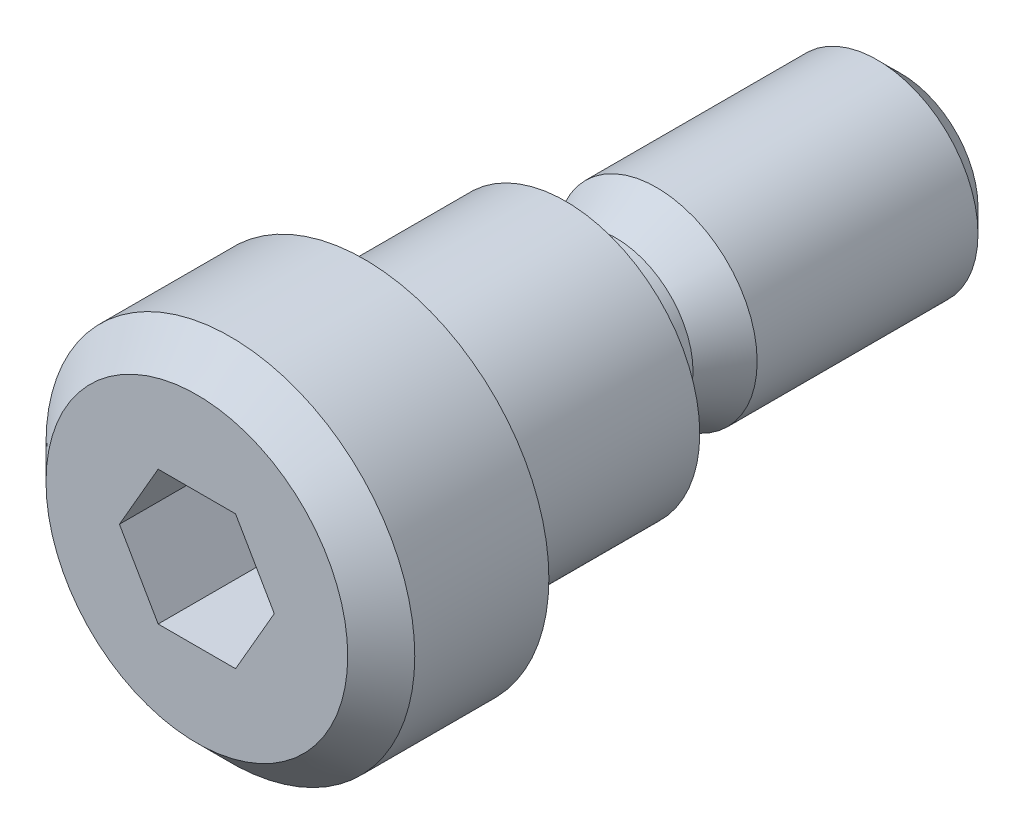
ISO-10303-21;
HEADER;
FILE_DESCRIPTION(('STEP AP214'),'2;1');
FILE_NAME('part.step','',(''),(''),'','','');
FILE_SCHEMA(('AUTOMOTIVE_DESIGN { 1 0 10303 214 1 1 1 1 }'));
ENDSEC;
DATA;
#1=APPLICATION_CONTEXT('core data for automotive mechanical design processes');
#2=APPLICATION_PROTOCOL_DEFINITION('international standard','automotive_design',2000,#1);
#3=PRODUCT_CONTEXT('',#1,'mechanical');
#4=PRODUCT('Part','Part','',(#3));
#5=PRODUCT_RELATED_PRODUCT_CATEGORY('part','',(#4));
#6=PRODUCT_DEFINITION_FORMATION('','',#4);
#7=PRODUCT_DEFINITION_CONTEXT('part definition',#1,'design');
#8=PRODUCT_DEFINITION('design','',#6,#7);
#9=PRODUCT_DEFINITION_SHAPE('','',#8);
#10=(LENGTH_UNIT() NAMED_UNIT(*) SI_UNIT(.MILLI.,.METRE.));
#11=(NAMED_UNIT(*) PLANE_ANGLE_UNIT() SI_UNIT($,.RADIAN.));
#12=(NAMED_UNIT(*) SI_UNIT($,.STERADIAN.) SOLID_ANGLE_UNIT());
#13=UNCERTAINTY_MEASURE_WITH_UNIT(LENGTH_MEASURE(1.E-05),#10,'distance_accuracy_value','');
#14=(GEOMETRIC_REPRESENTATION_CONTEXT(3) GLOBAL_UNCERTAINTY_ASSIGNED_CONTEXT((#13)) GLOBAL_UNIT_ASSIGNED_CONTEXT((#10,
#11,#12)) REPRESENTATION_CONTEXT('',''));
#15=CARTESIAN_POINT('',(0.,0.,0.));
#16=DIRECTION('',(0.,0.,1.));
#17=DIRECTION('',(1.,0.,0.));
#18=AXIS2_PLACEMENT_3D('',#15,#16,#17);
#19=CARTESIAN_POINT('',(0.,0.,-14.1819851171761));
#20=DIRECTION('',(0.,0.,-1.));
#21=DIRECTION('',(-1.,0.,0.));
#22=AXIS2_PLACEMENT_3D('',#19,#20,#21);
#23=CONICAL_SURFACE('',#22,0.499999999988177,1.2217304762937);
#24=CARTESIAN_POINT('',(0.,0.,-14.1819851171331));
#25=DIRECTION('',(0.,0.,1.));
#26=DIRECTION('',(1.,0.,0.));
#27=AXIS2_PLACEMENT_3D('',#24,#25,#26);
#28=CIRCLE('',#27,0.500000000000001);
#29=CARTESIAN_POINT('',(0.500000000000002,0.,-14.1819851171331));
#30=VERTEX_POINT('',#29);
#31=EDGE_CURVE('E236',#30,#30,#28,.F.);
#32=ORIENTED_EDGE('',*,*,#31,.T.);
#33=EDGE_LOOP('',(#32));
#34=FACE_BOUND('',#33,.T.);
#35=CARTESIAN_POINT('',(0.,-2.8421709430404E-10,-14.0000000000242));
#36=VERTEX_POINT('',#35);
#37=VERTEX_LOOP('',#36);
#38=FACE_BOUND('',#37,.T.);
#39=ADVANCED_FACE('F17',(#34,#38),#23,.F.);
#40=CARTESIAN_POINT('',(0.,0.,-14.7209925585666));
#41=DIRECTION('',(0.,0.,1.));
#42=DIRECTION('',(1.,0.,0.));
#43=AXIS2_PLACEMENT_3D('',#40,#41,#42);
#44=CYLINDRICAL_SURFACE('',#43,0.500000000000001);
#45=ORIENTED_EDGE('',*,*,#31,.F.);
#46=EDGE_LOOP('',(#45));
#47=FACE_BOUND('',#46,.T.);
#48=CARTESIAN_POINT('',(0.,0.,-15.260000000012));
#49=DIRECTION('',(0.,0.,-1.));
#50=DIRECTION('',(0.,-1.,0.));
#51=AXIS2_PLACEMENT_3D('',#48,#49,#50);
#52=CIRCLE('',#51,0.499999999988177);
#53=CARTESIAN_POINT('',(0.,-0.499999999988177,-15.260000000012));
#54=VERTEX_POINT('',#53);
#55=EDGE_CURVE('E232',#54,#54,#52,.T.);
#56=ORIENTED_EDGE('',*,*,#55,.T.);
#57=EDGE_LOOP('',(#56));
#58=FACE_BOUND('',#57,.T.);
#59=ADVANCED_FACE('F400',(#47,#58),#44,.F.);
#60=CARTESIAN_POINT('',(0.,0.,-15.999999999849));
#61=DIRECTION('',(0.,0.,-1.));
#62=DIRECTION('',(-1.,0.,0.));
#63=AXIS2_PLACEMENT_3D('',#60,#61,#62);
#64=CONICAL_SURFACE('',#63,0.927239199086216,0.52359877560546);
#65=ORIENTED_EDGE('',*,*,#55,.F.);
#66=EDGE_LOOP('',(#65));
#67=FACE_BOUND('',#66,.T.);
#68=CARTESIAN_POINT('',(0.,0.,-16.0000000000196));
#69=DIRECTION('',(0.,0.,-1.));
#70=DIRECTION('',(-1.,0.,0.));
#71=AXIS2_PLACEMENT_3D('',#68,#69,#70);
#72=CIRCLE('',#71,0.927239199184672);
#73=CARTESIAN_POINT('',(-0.92723919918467,0.,-16.0000000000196));
#74=VERTEX_POINT('',#73);
#75=EDGE_CURVE('E235',#74,#74,#72,.F.);
#76=ORIENTED_EDGE('',*,*,#75,.F.);
#77=EDGE_LOOP('',(#76));
#78=FACE_BOUND('',#77,.T.);
#79=ADVANCED_FACE('F398',(#67,#78),#64,.F.);
#80=CARTESIAN_POINT('',(0.,-1.61361959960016,-16.));
#81=DIRECTION('',(0.,0.,-1.));
#82=DIRECTION('',(-1.,0.,0.));
#83=AXIS2_PLACEMENT_3D('',#80,#81,#82);
#84=PLANE('',#83);
#85=CARTESIAN_POINT('',(0.,0.,-16.0000000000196));
#86=DIRECTION('',(0.,0.,1.));
#87=DIRECTION('',(1.,0.,0.));
#88=AXIS2_PLACEMENT_3D('',#85,#86,#87);
#89=CIRCLE('',#88,2.29999999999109);
#90=CARTESIAN_POINT('',(2.29999999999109,0.,-16.0000000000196));
#91=VERTEX_POINT('',#90);
#92=EDGE_CURVE('E231',#91,#91,#89,.T.);
#93=ORIENTED_EDGE('',*,*,#92,.F.);
#94=EDGE_LOOP('',(#93));
#95=FACE_BOUND('',#94,.T.);
#96=ORIENTED_EDGE('',*,*,#75,.T.);
#97=EDGE_LOOP('',(#96));
#98=FACE_BOUND('',#97,.T.);
#99=ADVANCED_FACE('F396',(#95,#98),#84,.T.);
#100=CARTESIAN_POINT('',(0.,0.,-15.2999999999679));
#101=DIRECTION('',(0.,0.,1.));
#102=DIRECTION('',(1.,0.,0.));
#103=AXIS2_PLACEMENT_3D('',#100,#101,#102);
#104=CONICAL_SURFACE('',#103,3.00000000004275,0.785398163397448);
#105=ORIENTED_EDGE('',*,*,#92,.T.);
#106=EDGE_LOOP('',(#105));
#107=FACE_BOUND('',#106,.T.);
#108=CARTESIAN_POINT('',(0.,0.,-15.3));
#109=DIRECTION('',(0.,0.,1.));
#110=DIRECTION('',(1.,0.,0.));
#111=AXIS2_PLACEMENT_3D('',#108,#109,#110);
#112=CIRCLE('',#111,3.);
#113=CARTESIAN_POINT('',(3.,0.,-15.3));
#114=VERTEX_POINT('',#113);
#115=EDGE_CURVE('E228',#114,#114,#112,.T.);
#116=ORIENTED_EDGE('',*,*,#115,.F.);
#117=EDGE_LOOP('',(#116));
#118=FACE_BOUND('',#117,.T.);
#119=ADVANCED_FACE('F407',(#107,#118),#104,.T.);
#120=CARTESIAN_POINT('',(0.,0.,-12.0062177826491));
#121=DIRECTION('',(0.,0.,1.));
#122=DIRECTION('',(1.,0.,0.));
#123=AXIS2_PLACEMENT_3D('',#120,#121,#122);
#124=CYLINDRICAL_SURFACE('',#123,3.);
#125=ORIENTED_EDGE('',*,*,#115,.T.);
#126=EDGE_LOOP('',(#125));
#127=FACE_BOUND('',#126,.T.);
#128=CARTESIAN_POINT('',(0.,0.,-8.71243556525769));
#129=DIRECTION('',(0.,0.,-1.));
#130=DIRECTION('',(0.,-1.,0.));
#131=AXIS2_PLACEMENT_3D('',#128,#129,#130);
#132=CIRCLE('',#131,3.00000000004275);
#133=CARTESIAN_POINT('',(0.,-3.00000000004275,-8.71243556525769));
#134=VERTEX_POINT('',#133);
#135=EDGE_CURVE('E225',#134,#134,#132,.F.);
#136=ORIENTED_EDGE('',*,*,#135,.F.);
#137=EDGE_LOOP('',(#136));
#138=FACE_BOUND('',#137,.T.);
#139=ADVANCED_FACE('F415',(#127,#138),#124,.T.);
#140=CARTESIAN_POINT('',(0.,0.,-8.71243556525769));
#141=DIRECTION('',(0.,0.,-1.));
#142=DIRECTION('',(-1.,0.,0.));
#143=AXIS2_PLACEMENT_3D('',#140,#141,#142);
#144=CONICAL_SURFACE('',#143,3.00000000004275,0.523598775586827);
#145=ORIENTED_EDGE('',*,*,#135,.T.);
#146=EDGE_LOOP('',(#145));
#147=FACE_BOUND('',#146,.T.);
#148=CARTESIAN_POINT('',(0.,0.,-7.5));
#149=DIRECTION('',(0.,0.,1.));
#150=DIRECTION('',(1.,0.,0.));
#151=AXIS2_PLACEMENT_3D('',#148,#149,#150);
#152=CIRCLE('',#151,2.3);
#153=CARTESIAN_POINT('',(2.3,0.,-7.5));
#154=VERTEX_POINT('',#153);
#155=EDGE_CURVE('E222',#154,#154,#152,.T.);
#156=ORIENTED_EDGE('',*,*,#155,.F.);
#157=EDGE_LOOP('',(#156));
#158=FACE_BOUND('',#157,.T.);
#159=ADVANCED_FACE('F419',(#147,#158),#144,.T.);
#160=CARTESIAN_POINT('',(0.,0.,-7.));
#161=DIRECTION('',(0.,0.,1.));
#162=DIRECTION('',(1.,0.,0.));
#163=AXIS2_PLACEMENT_3D('',#160,#161,#162);
#164=CYLINDRICAL_SURFACE('',#163,2.3);
#165=ORIENTED_EDGE('',*,*,#155,.T.);
#166=EDGE_LOOP('',(#165));
#167=FACE_BOUND('',#166,.T.);
#168=CARTESIAN_POINT('',(0.,0.,-6.5));
#169=DIRECTION('',(0.,0.,-1.));
#170=DIRECTION('',(-1.,0.,0.));
#171=AXIS2_PLACEMENT_3D('',#168,#169,#170);
#172=CIRCLE('',#171,2.3);
#173=CARTESIAN_POINT('',(-2.3,0.,-6.5));
#174=VERTEX_POINT('',#173);
#175=EDGE_CURVE('E214',#174,#174,#172,.T.);
#176=ORIENTED_EDGE('',*,*,#175,.T.);
#177=EDGE_LOOP('',(#176));
#178=FACE_BOUND('',#177,.T.);
#179=ADVANCED_FACE('F422',(#167,#178),#164,.T.);
#180=CARTESIAN_POINT('',(0.,0.,-6.5));
#181=DIRECTION('',(0.,0.,-1.));
#182=DIRECTION('',(-1.,0.,0.));
#183=AXIS2_PLACEMENT_3D('',#180,#181,#182);
#184=TOROIDAL_SURFACE('',#183,2.8,0.5);
#185=ORIENTED_EDGE('',*,*,#175,.F.);
#186=EDGE_LOOP('',(#185));
#187=FACE_BOUND('',#186,.T.);
#188=CARTESIAN_POINT('',(0.,0.,-6.));
#189=DIRECTION('',(0.,0.,-1.));
#190=DIRECTION('',(0.,-1.,0.));
#191=AXIS2_PLACEMENT_3D('',#188,#189,#190);
#192=CIRCLE('',#191,2.8);
#193=CARTESIAN_POINT('',(-2.8,0.,-6.));
#194=VERTEX_POINT('',#193);
#195=CARTESIAN_POINT('',(0.,-2.8,-6.));
#196=VERTEX_POINT('',#195);
#197=EDGE_CURVE('E166',#194,#196,#192,.F.);
#198=ORIENTED_EDGE('',*,*,#197,.F.);
#199=CARTESIAN_POINT('',(0.,0.,-6.));
#200=DIRECTION('',(0.,0.,-1.));
#201=DIRECTION('',(-1.,0.,0.));
#202=AXIS2_PLACEMENT_3D('',#199,#200,#201);
#203=CIRCLE('',#202,2.8);
#204=CARTESIAN_POINT('',(2.8,0.,-6.));
#205=VERTEX_POINT('',#204);
#206=EDGE_CURVE('E199',#205,#194,#203,.F.);
#207=ORIENTED_EDGE('',*,*,#206,.F.);
#208=CARTESIAN_POINT('',(0.,0.,-6.));
#209=DIRECTION('',(0.,0.,-1.));
#210=DIRECTION('',(1.,0.,0.));
#211=AXIS2_PLACEMENT_3D('',#208,#209,#210);
#212=CIRCLE('',#211,2.8);
#213=EDGE_CURVE('E375',#196,#205,#212,.F.);
#214=ORIENTED_EDGE('',*,*,#213,.F.);
#215=EDGE_LOOP('',(#198,#207,#214));
#216=FACE_BOUND('',#215,.T.);
#217=ADVANCED_FACE('F181',(#187,#216),#184,.F.);
#218=CARTESIAN_POINT('',(0.,-3.4,-6.));
#219=DIRECTION('',(0.,0.,-1.));
#220=DIRECTION('',(-1.,0.,0.));
#221=AXIS2_PLACEMENT_3D('',#218,#219,#220);
#222=PLANE('',#221);
#223=CARTESIAN_POINT('',(0.,0.,-6.));
#224=DIRECTION('',(0.,0.,1.));
#225=DIRECTION('',(1.,0.,0.));
#226=AXIS2_PLACEMENT_3D('',#223,#224,#225);
#227=CIRCLE('',#226,4.);
#228=CARTESIAN_POINT('',(4.,0.,-6.));
#229=VERTEX_POINT('',#228);
#230=EDGE_CURVE('E283',#229,#229,#227,.T.);
#231=ORIENTED_EDGE('',*,*,#230,.F.);
#232=EDGE_LOOP('',(#231));
#233=FACE_BOUND('',#232,.T.);
#234=ORIENTED_EDGE('',*,*,#213,.T.);
#235=ORIENTED_EDGE('',*,*,#206,.T.);
#236=ORIENTED_EDGE('',*,*,#197,.T.);
#237=EDGE_LOOP('',(#234,#235,#236));
#238=FACE_BOUND('',#237,.T.);
#239=ADVANCED_FACE('F172',(#233,#238),#222,.T.);
#240=CARTESIAN_POINT('',(0.,0.,2.00799999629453));
#241=DIRECTION('',(0.,0.,1.));
#242=DIRECTION('',(1.,0.,0.));
#243=AXIS2_PLACEMENT_3D('',#240,#241,#242);
#244=CONICAL_SURFACE('',#243,2.32325640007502,1.04719755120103);
#245=CARTESIAN_POINT('',(1.15470000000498,1.99999906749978,1.99999999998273));
#246=CARTESIAN_POINT('',(1.05991057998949,1.99999906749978,1.97263378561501));
#247=CARTESIAN_POINT('',(0.964371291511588,1.99999906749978,1.94757924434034));
#248=CARTESIAN_POINT('',(0.771740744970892,1.99999906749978,1.9032984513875));
#249=CARTESIAN_POINT('',(0.674646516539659,1.99999906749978,1.88408524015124));
#250=CARTESIAN_POINT('',(0.481547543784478,1.99999906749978,1.85318807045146));
#251=CARTESIAN_POINT('',(0.385569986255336,1.99999906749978,1.84133938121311));
#252=CARTESIAN_POINT('',(0.193061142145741,1.99999906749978,1.82543321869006));
#253=CARTESIAN_POINT('',(0.0965305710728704,1.99999906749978,1.8213672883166));
#254=CARTESIAN_POINT('',(-0.0965305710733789,1.99999906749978,1.8213672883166));
#255=CARTESIAN_POINT('',(-0.193061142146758,1.99999906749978,1.8254332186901));
#256=CARTESIAN_POINT('',(-0.385569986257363,1.99999906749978,1.84133938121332));
#257=CARTESIAN_POINT('',(-0.481547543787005,1.99999906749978,1.85318807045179));
#258=CARTESIAN_POINT('',(-0.674646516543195,1.99999906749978,1.88408524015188));
#259=CARTESIAN_POINT('',(-0.771740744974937,1.99999906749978,1.90329845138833));
#260=CARTESIAN_POINT('',(-0.964371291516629,1.99999906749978,1.9475792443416));
#261=CARTESIAN_POINT('',(-1.05991057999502,1.99999906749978,1.9726337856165));
#262=CARTESIAN_POINT('',(-1.154700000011,1.99999906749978,1.99999999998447));
#263=B_SPLINE_CURVE_WITH_KNOTS('',3,(#245,#246,#247,#248,#249,#250,#251,#252,#253,#254,#255,
#256,#257,#258,#259,#260,#261,#262),.UNSPECIFIED.,.F.,.F.,(4,2,2,2,2,2,2,2,4),(0.,
0.296073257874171,0.592802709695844,0.882630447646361,1.17214306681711,1.46165568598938,
1.75148342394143,2.04821287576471,2.34428613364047),.UNSPECIFIED.);
#264=CARTESIAN_POINT('',(1.15470000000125,1.99999906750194,1.99999999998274));
#265=VERTEX_POINT('',#264);
#266=CARTESIAN_POINT('',(-1.15470000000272,1.99999906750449,1.99999999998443));
#267=VERTEX_POINT('',#266);
#268=EDGE_CURVE('E93',#265,#267,#263,.T.);
#269=ORIENTED_EDGE('',*,*,#268,.T.);
#270=CARTESIAN_POINT('',(-1.1546999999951,1.99999906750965,1.99999999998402));
#271=CARTESIAN_POINT('',(-1.2054420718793,1.91211122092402,1.97069555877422));
#272=CARTESIAN_POINT('',(-1.25662214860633,1.82346472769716,1.9440447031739));
#273=CARTESIAN_POINT('',(-1.35986845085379,1.64463688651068,1.89752643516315));
#274=CARTESIAN_POINT('',(-1.41193651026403,1.55445236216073,1.87767547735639));
#275=CARTESIAN_POINT('',(-1.51542737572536,1.37520092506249,1.84677603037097));
#276=CARTESIAN_POINT('',(-1.56683426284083,1.28616158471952,1.83552186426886));
#277=CARTESIAN_POINT('',(-1.66988979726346,1.10766416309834,1.82208925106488));
#278=CARTESIAN_POINT('',(-1.7215380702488,1.01820673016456,1.81989967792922));
#279=CARTESIAN_POINT('',(-1.81803732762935,0.851065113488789,1.82446637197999));
#280=CARTESIAN_POINT('',(-1.86290279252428,0.773355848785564,1.83010136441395));
#281=CARTESIAN_POINT('',(-1.9523414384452,0.618443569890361,1.84795737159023));
#282=CARTESIAN_POINT('',(-1.99691431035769,0.541241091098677,1.86018447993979));
#283=CARTESIAN_POINT('',(-2.08653720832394,0.386009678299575,1.89074988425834));
#284=CARTESIAN_POINT('',(-2.13157589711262,0.308000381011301,1.90921768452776));
#285=CARTESIAN_POINT('',(-2.22098171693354,0.153144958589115,1.95113178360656));
#286=CARTESIAN_POINT('',(-2.26534999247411,0.0762968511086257,1.97456824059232));
#287=CARTESIAN_POINT('',(-2.30940000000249,-4.31724869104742E-12,1.99999999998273));
#288=B_SPLINE_CURVE_WITH_KNOTS('',3,(#270,#271,#272,#273,#274,#275,#276,#277,#278,#279,#280,
#281,#282,#283,#284,#285,#286,#287),.UNSPECIFIED.,.F.,.F.,(4,2,2,2,2,2,2,2,4),(0.,
0.317015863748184,0.634793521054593,0.944707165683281,1.25424030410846,1.52370707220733,
1.79342335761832,2.06912065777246,2.3442768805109),.UNSPECIFIED.);
#289=CARTESIAN_POINT('',(-2.30940000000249,0.,1.99999999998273));
#290=VERTEX_POINT('',#289);
#291=EDGE_CURVE('E98',#267,#290,#288,.T.);
#292=ORIENTED_EDGE('',*,*,#291,.T.);
#293=CARTESIAN_POINT('',(-2.30940000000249,4.31510744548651E-12,1.99999999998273));
#294=CARTESIAN_POINT('',(-2.25865792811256,-0.0878878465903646,1.97069555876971));
#295=CARTESIAN_POINT('',(-2.20747785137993,-0.176534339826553,1.94404470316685));
#296=CARTESIAN_POINT('',(-2.10423154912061,-0.35536218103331,1.89752643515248));
#297=CARTESIAN_POINT('',(-2.05216348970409,-0.445546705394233,1.87767547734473));
#298=CARTESIAN_POINT('',(-1.9486726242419,-0.624798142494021,1.84677603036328));
#299=CARTESIAN_POINT('',(-1.897265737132,-0.71383748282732,1.83552186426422));
#300=CARTESIAN_POINT('',(-1.79421020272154,-0.89233490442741,1.82208925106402));
#301=CARTESIAN_POINT('',(-1.7425619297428,-0.981792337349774,1.81989967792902));
#302=CARTESIAN_POINT('',(-1.64606267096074,-1.14893395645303,1.82446637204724));
#303=CARTESIAN_POINT('',(-1.60119720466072,-1.22664322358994,1.83010136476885));
#304=CARTESIAN_POINT('',(-1.51175855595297,-1.38155550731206,1.84795737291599));
#305=CARTESIAN_POINT('',(-1.46718568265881,-1.45875798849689,1.8601844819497));
#306=CARTESIAN_POINT('',(-1.37756278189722,-1.61398940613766,1.89074988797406));
#307=CARTESIAN_POINT('',(-1.33252409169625,-1.69199870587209,1.90921768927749));
#308=CARTESIAN_POINT('',(-1.24311826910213,-1.84685413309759,1.95113179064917));
#309=CARTESIAN_POINT('',(-1.19874999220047,-1.92370224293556,1.97456824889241));
#310=CARTESIAN_POINT('',(-1.15469998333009,-1.99999909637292,2.00000000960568));
#311=B_SPLINE_CURVE_WITH_KNOTS('',3,(#293,#294,#295,#296,#297,#298,#299,#300,#301,#302,#303,
#304,#305,#306,#307,#308,#309,#310),.UNSPECIFIED.,.F.,.F.,(4,2,2,2,2,2,2,2,4),(0.,
0.317015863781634,0.634793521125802,0.94470716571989,1.25424030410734,1.52370708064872,
1.79342337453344,2.06912068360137,2.34427691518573),.UNSPECIFIED.);
#312=CARTESIAN_POINT('',(-1.15469994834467,-1.99999908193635,1.99999999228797));
#313=VERTEX_POINT('',#312);
#314=EDGE_CURVE('E126',#290,#313,#311,.T.);
#315=ORIENTED_EDGE('',*,*,#314,.T.);
#316=CARTESIAN_POINT('',(1.154700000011,-1.99999906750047,1.99999999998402));
#317=CARTESIAN_POINT('',(1.05991058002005,-1.99999906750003,1.97263378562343));
#318=CARTESIAN_POINT('',(0.964371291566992,-1.99999906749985,1.9475792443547));
#319=CARTESIAN_POINT('',(0.771740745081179,-1.99999906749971,1.90329845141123));
#320=CARTESIAN_POINT('',(0.674646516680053,-1.99999906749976,1.88408524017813));
#321=CARTESIAN_POINT('',(0.481547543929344,-1.9999990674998,1.85318807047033));
#322=CARTESIAN_POINT('',(0.385569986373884,-1.99999906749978,1.84133938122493));
#323=CARTESIAN_POINT('',(0.193061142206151,-1.99999906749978,1.82543321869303));
#324=CARTESIAN_POINT('',(0.0965305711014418,-1.99999906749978,1.82136728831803));
#325=CARTESIAN_POINT('',(-0.0965305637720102,-1.99999906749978,1.82136728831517));
#326=CARTESIAN_POINT('',(-0.193061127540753,-1.99999906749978,1.82543321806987));
#327=CARTESIAN_POINT('',(-0.385569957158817,-1.99999906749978,1.84133937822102));
#328=CARTESIAN_POINT('',(-0.48154750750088,-1.99999906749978,1.85318806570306));
#329=CARTESIAN_POINT('',(-0.674646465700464,-1.99999906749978,1.88408523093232));
#330=CARTESIAN_POINT('',(-0.771740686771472,-1.99999906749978,1.90329843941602));
#331=CARTESIAN_POINT('',(-0.964371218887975,-1.99999906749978,1.94757922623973));
#332=CARTESIAN_POINT('',(-1.05991050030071,-1.99999906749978,1.97263376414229));
#333=CARTESIAN_POINT('',(-1.1546999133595,-1.99999906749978,1.99999997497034));
#334=B_SPLINE_CURVE_WITH_KNOTS('',3,(#316,#317,#318,#319,#320,#321,#322,#323,#324,#325,#326,
#327,#328,#329,#330,#331,#332,#333),.UNSPECIFIED.,.F.,.F.,(4,2,2,2,2,2,2,2,4),(0.,
0.296073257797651,0.592802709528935,0.882630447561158,1.17214306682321,1.46165566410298,
1.75148338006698,2.04821280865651,2.34428604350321),.UNSPECIFIED.);
#335=CARTESIAN_POINT('',(1.15470000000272,-1.99999906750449,1.99999999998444));
#336=VERTEX_POINT('',#335);
#337=EDGE_CURVE('E383',#336,#313,#334,.T.);
#338=ORIENTED_EDGE('',*,*,#337,.F.);
#339=CARTESIAN_POINT('',(1.1546999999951,-1.99999906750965,1.99999999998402));
#340=CARTESIAN_POINT('',(1.2054420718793,-1.91211122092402,1.97069555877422));
#341=CARTESIAN_POINT('',(1.25662214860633,-1.82346472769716,1.9440447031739));
#342=CARTESIAN_POINT('',(1.35986845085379,-1.64463688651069,1.89752643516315));
#343=CARTESIAN_POINT('',(1.41193651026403,-1.55445236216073,1.87767547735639));
#344=CARTESIAN_POINT('',(1.51542737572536,-1.3752009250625,1.84677603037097));
#345=CARTESIAN_POINT('',(1.56683426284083,-1.28616158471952,1.83552186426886));
#346=CARTESIAN_POINT('',(1.66988979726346,-1.10766416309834,1.82208925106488));
#347=CARTESIAN_POINT('',(1.7215380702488,-1.01820673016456,1.81989967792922));
#348=CARTESIAN_POINT('',(1.81803732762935,-0.85106511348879,1.82446637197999));
#349=CARTESIAN_POINT('',(1.86290279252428,-0.773355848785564,1.83010136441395));
#350=CARTESIAN_POINT('',(1.9523414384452,-0.618443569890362,1.84795737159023));
#351=CARTESIAN_POINT('',(1.99691431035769,-0.541241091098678,1.86018447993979));
#352=CARTESIAN_POINT('',(2.08653720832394,-0.386009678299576,1.89074988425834));
#353=CARTESIAN_POINT('',(2.13157589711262,-0.308000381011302,1.90921768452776));
#354=CARTESIAN_POINT('',(2.22098171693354,-0.153144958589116,1.95113178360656));
#355=CARTESIAN_POINT('',(2.26534999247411,-0.0762968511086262,1.97456824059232));
#356=CARTESIAN_POINT('',(2.30940000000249,4.31705356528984E-12,1.99999999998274));
#357=B_SPLINE_CURVE_WITH_KNOTS('',3,(#339,#340,#341,#342,#343,#344,#345,#346,#347,#348,#349,
#350,#351,#352,#353,#354,#355,#356),.UNSPECIFIED.,.F.,.F.,(4,2,2,2,2,2,2,2,4),(0.,
0.317015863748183,0.634793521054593,0.94470716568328,1.25424030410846,1.52370707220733,
1.79342335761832,2.06912065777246,2.3442768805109),.UNSPECIFIED.);
#358=CARTESIAN_POINT('',(2.30940000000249,0.,1.99999999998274));
#359=VERTEX_POINT('',#358);
#360=EDGE_CURVE('E242',#336,#359,#357,.T.);
#361=ORIENTED_EDGE('',*,*,#360,.T.);
#362=CARTESIAN_POINT('',(2.30940000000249,-4.31498290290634E-12,1.99999999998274));
#363=CARTESIAN_POINT('',(2.25865792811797,0.0878878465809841,1.9706955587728));
#364=CARTESIAN_POINT('',(2.20747785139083,0.176534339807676,1.94404470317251));
#365=CARTESIAN_POINT('',(2.10423154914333,0.355362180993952,1.89752643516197));
#366=CARTESIAN_POINT('',(2.05216348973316,0.445546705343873,1.8776754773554));
#367=CARTESIAN_POINT('',(1.94867262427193,0.624798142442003,1.84677603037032));
#368=CARTESIAN_POINT('',(1.89726573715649,0.713837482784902,1.83552186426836));
#369=CARTESIAN_POINT('',(1.79421020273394,0.892334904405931,1.82208925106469));
#370=CARTESIAN_POINT('',(1.74256192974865,0.981792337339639,1.8198996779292));
#371=CARTESIAN_POINT('',(1.64606267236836,1.14893395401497,1.82446637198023));
#372=CARTESIAN_POINT('',(1.60119720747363,1.22664321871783,1.83010136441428));
#373=CARTESIAN_POINT('',(1.51175856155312,1.38155549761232,1.84795737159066));
#374=CARTESIAN_POINT('',(1.46718568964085,1.45875797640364,1.86018447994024));
#375=CARTESIAN_POINT('',(1.37756279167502,1.61398938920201,1.89074988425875));
#376=CARTESIAN_POINT('',(1.33252410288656,1.69199868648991,1.90921768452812));
#377=CARTESIAN_POINT('',(1.24311828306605,1.84685410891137,1.95113178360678));
#378=CARTESIAN_POINT('',(1.19875000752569,1.92370221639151,1.97456824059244));
#379=CARTESIAN_POINT('',(1.15469999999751,1.9999990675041,1.99999999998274));
#380=B_SPLINE_CURVE_WITH_KNOTS('',3,(#362,#363,#364,#365,#366,#367,#368,#369,#370,#371,#372,
#373,#374,#375,#376,#377,#378,#379),.UNSPECIFIED.,.F.,.F.,(4,2,2,2,2,2,2,2,4),(0.,
0.317015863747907,0.634793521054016,0.944707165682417,1.25424030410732,1.52370707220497,
1.79342335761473,2.06912065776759,2.34427688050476),.UNSPECIFIED.);
#381=EDGE_CURVE('E101',#359,#265,#380,.T.);
#382=ORIENTED_EDGE('',*,*,#381,.T.);
#383=EDGE_LOOP('',(#269,#292,#315,#338,#361,#382));
#384=FACE_BOUND('',#383,.T.);
#385=CARTESIAN_POINT('',(0.,2.8421709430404E-11,0.666667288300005));
#386=VERTEX_POINT('',#385);
#387=VERTEX_LOOP('',#386);
#388=FACE_BOUND('',#387,.T.);
#389=ADVANCED_FACE('F95',(#384,#388),#244,.F.);
#390=CARTESIAN_POINT('',(0.,0.,-3.5));
#391=DIRECTION('',(0.,0.,1.));
#392=DIRECTION('',(1.,0.,0.));
#393=AXIS2_PLACEMENT_3D('',#390,#391,#392);
#394=CYLINDRICAL_SURFACE('',#393,4.);
#395=ORIENTED_EDGE('',*,*,#230,.T.);
#396=EDGE_LOOP('',(#395));
#397=FACE_BOUND('',#396,.T.);
#398=CARTESIAN_POINT('',(0.,0.,-1.));
#399=DIRECTION('',(0.,0.,-1.));
#400=DIRECTION('',(-1.,0.,0.));
#401=AXIS2_PLACEMENT_3D('',#398,#399,#400);
#402=CIRCLE('',#401,4.);
#403=CARTESIAN_POINT('',(-4.,0.,-1.));
#404=VERTEX_POINT('',#403);
#405=EDGE_CURVE('E129',#404,#404,#402,.T.);
#406=ORIENTED_EDGE('',*,*,#405,.T.);
#407=EDGE_LOOP('',(#406));
#408=FACE_BOUND('',#407,.T.);
#409=ADVANCED_FACE('F288',(#397,#408),#394,.T.);
#410=CARTESIAN_POINT('',(-2.3094,0.,5.));
#411=DIRECTION('',(-0.866025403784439,-0.5,0.));
#412=DIRECTION('',(0.5,-0.866025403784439,0.));
#413=AXIS2_PLACEMENT_3D('',#410,#411,#412);
#414=PLANE('',#413);
#415=DIRECTION('',(0.,0.,1.));
#416=VECTOR('',#415,1.);
#417=CARTESIAN_POINT('',(-2.3094,0.,5.));
#418=LINE('',#417,#416);
#419=CARTESIAN_POINT('',(-2.3094,0.,5.));
#420=VERTEX_POINT('',#419);
#421=EDGE_CURVE('E112',#290,#420,#418,.T.);
#422=ORIENTED_EDGE('',*,*,#421,.T.);
#423=DIRECTION('',(-0.500000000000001,0.866025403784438,0.));
#424=VECTOR('',#423,1.);
#425=CARTESIAN_POINT('',(-1.1547,-1.99999906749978,5.));
#426=LINE('',#425,#424);
#427=CARTESIAN_POINT('',(-1.1547,-1.99999906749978,5.));
#428=VERTEX_POINT('',#427);
#429=EDGE_CURVE('E132',#428,#420,#426,.T.);
#430=ORIENTED_EDGE('',*,*,#429,.F.);
#431=DIRECTION('',(0.,0.,-1.));
#432=VECTOR('',#431,1.);
#433=CARTESIAN_POINT('',(-1.1547,-1.99999906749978,5.));
#434=LINE('',#433,#432);
#435=EDGE_CURVE('E133',#428,#313,#434,.T.);
#436=ORIENTED_EDGE('',*,*,#435,.T.);
#437=ORIENTED_EDGE('',*,*,#314,.F.);
#438=EDGE_LOOP('',(#422,#430,#436,#437));
#439=FACE_BOUND('',#438,.T.);
#440=ADVANCED_FACE('F285',(#439),#414,.F.);
#441=CARTESIAN_POINT('',(-1.1547,1.99999906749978,5.));
#442=DIRECTION('',(-0.866025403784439,0.5,0.));
#443=DIRECTION('',(-0.5,-0.866025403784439,0.));
#444=AXIS2_PLACEMENT_3D('',#441,#442,#443);
#445=PLANE('',#444);
#446=DIRECTION('',(0.,0.,1.));
#447=VECTOR('',#446,1.);
#448=CARTESIAN_POINT('',(-1.1547,1.99999906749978,5.));
#449=LINE('',#448,#447);
#450=CARTESIAN_POINT('',(-1.1547,1.99999906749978,5.));
#451=VERTEX_POINT('',#450);
#452=EDGE_CURVE('E106',#267,#451,#449,.T.);
#453=ORIENTED_EDGE('',*,*,#452,.T.);
#454=DIRECTION('',(0.5,0.866025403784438,0.));
#455=VECTOR('',#454,1.);
#456=CARTESIAN_POINT('',(-2.3094,0.,5.));
#457=LINE('',#456,#455);
#458=EDGE_CURVE('E136',#420,#451,#457,.T.);
#459=ORIENTED_EDGE('',*,*,#458,.F.);
#460=ORIENTED_EDGE('',*,*,#421,.F.);
#461=ORIENTED_EDGE('',*,*,#291,.F.);
#462=EDGE_LOOP('',(#453,#459,#460,#461));
#463=FACE_BOUND('',#462,.T.);
#464=ADVANCED_FACE('F109',(#463),#445,.F.);
#465=CARTESIAN_POINT('',(1.1547,1.99999906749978,5.));
#466=DIRECTION('',(0.,1.,0.));
#467=DIRECTION('',(-1.,0.,0.));
#468=AXIS2_PLACEMENT_3D('',#465,#466,#467);
#469=PLANE('',#468);
#470=ORIENTED_EDGE('',*,*,#268,.F.);
#471=DIRECTION('',(0.,0.,1.));
#472=VECTOR('',#471,1.);
#473=CARTESIAN_POINT('',(1.1547,1.99999906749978,5.));
#474=LINE('',#473,#472);
#475=CARTESIAN_POINT('',(1.1547,1.99999906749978,5.));
#476=VERTEX_POINT('',#475);
#477=EDGE_CURVE('E105',#265,#476,#474,.T.);
#478=ORIENTED_EDGE('',*,*,#477,.T.);
#479=DIRECTION('',(1.,0.,0.));
#480=VECTOR('',#479,1.);
#481=CARTESIAN_POINT('',(0.,1.99999906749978,5.));
#482=LINE('',#481,#480);
#483=EDGE_CURVE('E116',#451,#476,#482,.T.);
#484=ORIENTED_EDGE('',*,*,#483,.F.);
#485=ORIENTED_EDGE('',*,*,#452,.F.);
#486=EDGE_LOOP('',(#470,#478,#484,#485));
#487=FACE_BOUND('',#486,.T.);
#488=ADVANCED_FACE('F114',(#487),#469,.F.);
#489=CARTESIAN_POINT('',(2.3094,0.,5.));
#490=DIRECTION('',(0.866025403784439,0.5,0.));
#491=DIRECTION('',(-0.5,0.866025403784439,0.));
#492=AXIS2_PLACEMENT_3D('',#489,#490,#491);
#493=PLANE('',#492);
#494=DIRECTION('',(0.,0.,1.));
#495=VECTOR('',#494,1.);
#496=CARTESIAN_POINT('',(2.3094,0.,5.));
#497=LINE('',#496,#495);
#498=CARTESIAN_POINT('',(2.3094,0.,5.));
#499=VERTEX_POINT('',#498);
#500=EDGE_CURVE('E249',#359,#499,#497,.T.);
#501=ORIENTED_EDGE('',*,*,#500,.T.);
#502=DIRECTION('',(0.5,-0.866025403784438,0.));
#503=VECTOR('',#502,1.);
#504=CARTESIAN_POINT('',(1.1547,1.99999906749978,5.));
#505=LINE('',#504,#503);
#506=EDGE_CURVE('E148',#476,#499,#505,.T.);
#507=ORIENTED_EDGE('',*,*,#506,.F.);
#508=ORIENTED_EDGE('',*,*,#477,.F.);
#509=ORIENTED_EDGE('',*,*,#381,.F.);
#510=EDGE_LOOP('',(#501,#507,#508,#509));
#511=FACE_BOUND('',#510,.T.);
#512=ADVANCED_FACE('F259',(#511),#493,.F.);
#513=CARTESIAN_POINT('',(1.1547,-1.99999906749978,5.));
#514=DIRECTION('',(0.866025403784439,-0.5,0.));
#515=DIRECTION('',(0.5,0.866025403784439,0.));
#516=AXIS2_PLACEMENT_3D('',#513,#514,#515);
#517=PLANE('',#516);
#518=DIRECTION('',(0.,0.,-1.));
#519=VECTOR('',#518,1.);
#520=CARTESIAN_POINT('',(1.1547,-1.99999906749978,5.));
#521=LINE('',#520,#519);
#522=CARTESIAN_POINT('',(1.1547,-1.99999906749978,5.));
#523=VERTEX_POINT('',#522);
#524=EDGE_CURVE('E248',#336,#523,#521,.F.);
#525=ORIENTED_EDGE('',*,*,#524,.T.);
#526=DIRECTION('',(-0.5,-0.866025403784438,0.));
#527=VECTOR('',#526,1.);
#528=CARTESIAN_POINT('',(2.3094,0.,5.));
#529=LINE('',#528,#527);
#530=EDGE_CURVE('E143',#499,#523,#529,.T.);
#531=ORIENTED_EDGE('',*,*,#530,.F.);
#532=ORIENTED_EDGE('',*,*,#500,.F.);
#533=ORIENTED_EDGE('',*,*,#360,.F.);
#534=EDGE_LOOP('',(#525,#531,#532,#533));
#535=FACE_BOUND('',#534,.T.);
#536=ADVANCED_FACE('F254',(#535),#517,.F.);
#537=CARTESIAN_POINT('',(-1.1547,-1.99999906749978,5.));
#538=DIRECTION('',(0.,-1.,0.));
#539=DIRECTION('',(0.,0.,-1.));
#540=AXIS2_PLACEMENT_3D('',#537,#538,#539);
#541=PLANE('',#540);
#542=ORIENTED_EDGE('',*,*,#337,.T.);
#543=ORIENTED_EDGE('',*,*,#435,.F.);
#544=DIRECTION('',(1.,0.,0.));
#545=VECTOR('',#544,1.);
#546=CARTESIAN_POINT('',(0.,-1.99999906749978,5.));
#547=LINE('',#546,#545);
#548=EDGE_CURVE('E139',#523,#428,#547,.F.);
#549=ORIENTED_EDGE('',*,*,#548,.F.);
#550=ORIENTED_EDGE('',*,*,#524,.F.);
#551=EDGE_LOOP('',(#542,#543,#549,#550));
#552=FACE_BOUND('',#551,.T.);
#553=ADVANCED_FACE('F258',(#552),#541,.F.);
#554=CARTESIAN_POINT('',(0.,-2.25,5.));
#555=DIRECTION('',(0.,0.,1.));
#556=DIRECTION('',(1.,0.,0.));
#557=AXIS2_PLACEMENT_3D('',#554,#555,#556);
#558=PLANE('',#557);
#559=CARTESIAN_POINT('',(0.,0.,4.99999999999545));
#560=DIRECTION('',(0.,0.,-1.));
#561=DIRECTION('',(-1.,0.,0.));
#562=AXIS2_PLACEMENT_3D('',#559,#560,#561);
#563=CIRCLE('',#562,4.50000000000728);
#564=CARTESIAN_POINT('',(-4.50000000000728,0.,4.99999999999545));
#565=VERTEX_POINT('',#564);
#566=EDGE_CURVE('E142',#565,#565,#563,.T.);
#567=ORIENTED_EDGE('',*,*,#566,.F.);
#568=EDGE_LOOP('',(#567));
#569=FACE_BOUND('',#568,.T.);
#570=ORIENTED_EDGE('',*,*,#530,.T.);
#571=ORIENTED_EDGE('',*,*,#548,.T.);
#572=ORIENTED_EDGE('',*,*,#429,.T.);
#573=ORIENTED_EDGE('',*,*,#458,.T.);
#574=ORIENTED_EDGE('',*,*,#483,.T.);
#575=ORIENTED_EDGE('',*,*,#506,.T.);
#576=EDGE_LOOP('',(#570,#571,#572,#573,#574,#575));
#577=FACE_BOUND('',#576,.T.);
#578=ADVANCED_FACE('F347',(#569,#577),#558,.T.);
#579=CARTESIAN_POINT('',(0.,0.,-0.5));
#580=DIRECTION('',(0.,0.,-1.));
#581=DIRECTION('',(-1.,0.,0.));
#582=AXIS2_PLACEMENT_3D('',#579,#580,#581);
#583=TOROIDAL_SURFACE('',#582,4.,0.5);
#584=ORIENTED_EDGE('',*,*,#405,.F.);
#585=EDGE_LOOP('',(#584));
#586=FACE_BOUND('',#585,.T.);
#587=CARTESIAN_POINT('',(0.,0.,0.));
#588=DIRECTION('',(0.,0.,-1.));
#589=DIRECTION('',(-1.,0.,0.));
#590=AXIS2_PLACEMENT_3D('',#587,#588,#589);
#591=CIRCLE('',#590,4.);
#592=CARTESIAN_POINT('',(4.,0.,0.));
#593=VERTEX_POINT('',#592);
#594=CARTESIAN_POINT('',(-4.,0.,0.));
#595=VERTEX_POINT('',#594);
#596=EDGE_CURVE('E37',#593,#595,#591,.F.);
#597=ORIENTED_EDGE('',*,*,#596,.F.);
#598=CARTESIAN_POINT('',(0.,0.,0.));
#599=DIRECTION('',(0.,0.,-1.));
#600=DIRECTION('',(1.,0.,0.));
#601=AXIS2_PLACEMENT_3D('',#598,#599,#600);
#602=CIRCLE('',#601,4.);
#603=CARTESIAN_POINT('',(0.,-4.,0.));
#604=VERTEX_POINT('',#603);
#605=EDGE_CURVE('E606',#604,#593,#602,.F.);
#606=ORIENTED_EDGE('',*,*,#605,.F.);
#607=CARTESIAN_POINT('',(0.,0.,0.));
#608=DIRECTION('',(0.,0.,-1.));
#609=DIRECTION('',(0.,-1.,0.));
#610=AXIS2_PLACEMENT_3D('',#607,#608,#609);
#611=CIRCLE('',#610,4.);
#612=EDGE_CURVE('E241',#595,#604,#611,.F.);
#613=ORIENTED_EDGE('',*,*,#612,.F.);
#614=EDGE_LOOP('',(#597,#606,#613));
#615=FACE_BOUND('',#614,.T.);
#616=ADVANCED_FACE('F344',(#586,#615),#583,.F.);
#617=CARTESIAN_POINT('',(0.,0.,4.00000000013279));
#618=DIRECTION('',(0.,0.,-1.));
#619=DIRECTION('',(-1.,0.,0.));
#620=AXIS2_PLACEMENT_3D('',#617,#618,#619);
#621=CONICAL_SURFACE('',#620,5.49999999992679,0.78539816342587);
#622=ORIENTED_EDGE('',*,*,#566,.T.);
#623=EDGE_LOOP('',(#622));
#624=FACE_BOUND('',#623,.T.);
#625=CARTESIAN_POINT('',(0.,0.,4.));
#626=DIRECTION('',(0.,0.,1.));
#627=DIRECTION('',(1.,0.,0.));
#628=AXIS2_PLACEMENT_3D('',#625,#626,#627);
#629=CIRCLE('',#628,5.5);
#630=CARTESIAN_POINT('',(5.5,0.,4.));
#631=VERTEX_POINT('',#630);
#632=EDGE_CURVE('E28',#631,#631,#629,.F.);
#633=ORIENTED_EDGE('',*,*,#632,.F.);
#634=EDGE_LOOP('',(#633));
#635=FACE_BOUND('',#634,.T.);
#636=ADVANCED_FACE('F306',(#624,#635),#621,.T.);
#637=CARTESIAN_POINT('',(0.,-4.75,0.));
#638=DIRECTION('',(0.,0.,-1.));
#639=DIRECTION('',(-1.,0.,0.));
#640=AXIS2_PLACEMENT_3D('',#637,#638,#639);
#641=PLANE('',#640);
#642=CARTESIAN_POINT('',(0.,0.,0.));
#643=DIRECTION('',(0.,0.,1.));
#644=DIRECTION('',(1.,0.,0.));
#645=AXIS2_PLACEMENT_3D('',#642,#643,#644);
#646=CIRCLE('',#645,5.5);
#647=CARTESIAN_POINT('',(5.5,0.,0.));
#648=VERTEX_POINT('',#647);
#649=EDGE_CURVE('E11',#648,#648,#646,.T.);
#650=ORIENTED_EDGE('',*,*,#649,.F.);
#651=EDGE_LOOP('',(#650));
#652=FACE_BOUND('',#651,.T.);
#653=ORIENTED_EDGE('',*,*,#605,.T.);
#654=ORIENTED_EDGE('',*,*,#596,.T.);
#655=ORIENTED_EDGE('',*,*,#612,.T.);
#656=EDGE_LOOP('',(#653,#654,#655));
#657=FACE_BOUND('',#656,.T.);
#658=ADVANCED_FACE('F300',(#652,#657),#641,.T.);
#659=CARTESIAN_POINT('',(0.,0.,2.));
#660=DIRECTION('',(0.,0.,1.));
#661=DIRECTION('',(1.,0.,0.));
#662=AXIS2_PLACEMENT_3D('',#659,#660,#661);
#663=CYLINDRICAL_SURFACE('',#662,5.5);
#664=ORIENTED_EDGE('',*,*,#632,.T.);
#665=EDGE_LOOP('',(#664));
#666=FACE_BOUND('',#665,.T.);
#667=ORIENTED_EDGE('',*,*,#649,.T.);
#668=EDGE_LOOP('',(#667));
#669=FACE_BOUND('',#668,.T.);
#670=ADVANCED_FACE('F298',(#666,#669),#663,.T.);
#671=CLOSED_SHELL('',(#39,#59,#79,#99,#119,#139,#159,#179,#217,#239,#389,#409,#440,#464,#488,
#512,#536,#553,#578,#616,#636,#658,#670));
#672=MANIFOLD_SOLID_BREP('B1',#671);
#673=ADVANCED_BREP_SHAPE_REPRESENTATION('',(#18,#672),#14);
#674=SHAPE_DEFINITION_REPRESENTATION(#9,#673);
ENDSEC;
END-ISO-10303-21;
